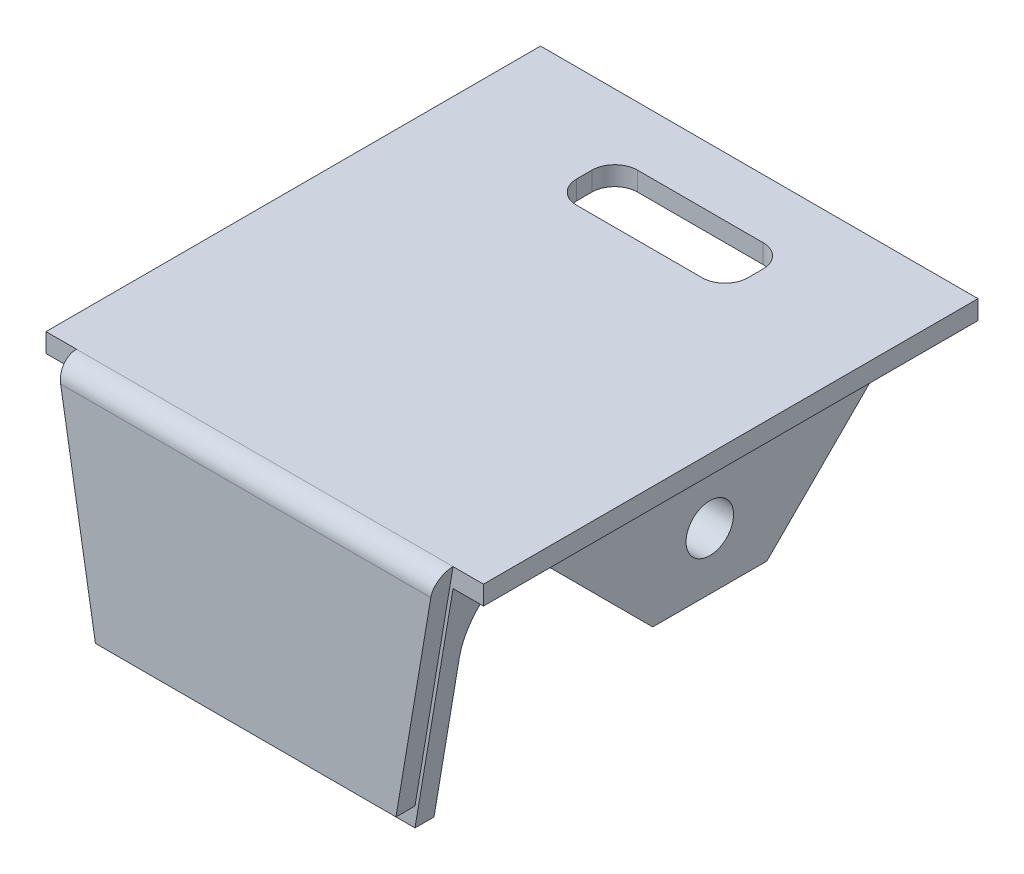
ISO-10303-21;
HEADER;
FILE_DESCRIPTION(('STEP AP214'),'2;1');
FILE_NAME('part.step','',(''),(''),'','','');
FILE_SCHEMA(('AUTOMOTIVE_DESIGN { 1 0 10303 214 1 1 1 1 }'));
ENDSEC;
DATA;
#1=APPLICATION_CONTEXT('core data for automotive mechanical design processes');
#2=APPLICATION_PROTOCOL_DEFINITION('international standard','automotive_design',2000,#1);
#3=PRODUCT_CONTEXT('',#1,'mechanical');
#4=PRODUCT('Part','Part','',(#3));
#5=PRODUCT_RELATED_PRODUCT_CATEGORY('part','',(#4));
#6=PRODUCT_DEFINITION_FORMATION('','',#4);
#7=PRODUCT_DEFINITION_CONTEXT('part definition',#1,'design');
#8=PRODUCT_DEFINITION('design','',#6,#7);
#9=PRODUCT_DEFINITION_SHAPE('','',#8);
#10=(LENGTH_UNIT() NAMED_UNIT(*) SI_UNIT(.MILLI.,.METRE.));
#11=(NAMED_UNIT(*) PLANE_ANGLE_UNIT() SI_UNIT($,.RADIAN.));
#12=(NAMED_UNIT(*) SI_UNIT($,.STERADIAN.) SOLID_ANGLE_UNIT());
#13=UNCERTAINTY_MEASURE_WITH_UNIT(LENGTH_MEASURE(1.E-05),#10,'distance_accuracy_value','');
#14=(GEOMETRIC_REPRESENTATION_CONTEXT(3) GLOBAL_UNCERTAINTY_ASSIGNED_CONTEXT((#13)) GLOBAL_UNIT_ASSIGNED_CONTEXT((#10,
#11,#12)) REPRESENTATION_CONTEXT('',''));
#15=CARTESIAN_POINT('',(0.,0.,0.));
#16=DIRECTION('',(0.,0.,1.));
#17=DIRECTION('',(1.,0.,0.));
#18=AXIS2_PLACEMENT_3D('',#15,#16,#17);
#19=CARTESIAN_POINT('',(0.,0.,0.));
#20=DIRECTION('',(0.,1.,0.));
#21=DIRECTION('',(0.,0.,1.));
#22=AXIS2_PLACEMENT_3D('',#19,#20,#21);
#23=PLANE('',#22);
#24=DIRECTION('',(-1.,0.,0.));
#25=VECTOR('',#24,1.);
#26=CARTESIAN_POINT('',(3.3,0.,-6.70000000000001));
#27=LINE('',#26,#25);
#28=CARTESIAN_POINT('',(3.3,0.,-6.70000000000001));
#29=VERTEX_POINT('',#28);
#30=CARTESIAN_POINT('',(-3.3,0.,-6.70000000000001));
#31=VERTEX_POINT('',#30);
#32=EDGE_CURVE('E631',#29,#31,#27,.T.);
#33=ORIENTED_EDGE('',*,*,#32,.F.);
#34=CARTESIAN_POINT('',(3.3,0.,-7.90000000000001));
#35=DIRECTION('',(0.,1.,0.));
#36=DIRECTION('',(0.,0.,1.));
#37=AXIS2_PLACEMENT_3D('',#34,#35,#36);
#38=CIRCLE('',#37,1.2);
#39=CARTESIAN_POINT('',(4.5,0.,-7.90000000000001));
#40=VERTEX_POINT('',#39);
#41=EDGE_CURVE('E302',#40,#29,#38,.F.);
#42=ORIENTED_EDGE('',*,*,#41,.F.);
#43=DIRECTION('',(0.,0.,1.));
#44=VECTOR('',#43,1.);
#45=CARTESIAN_POINT('',(4.5,0.,-8.70000000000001));
#46=LINE('',#45,#44);
#47=CARTESIAN_POINT('',(4.5,0.,-8.70000000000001));
#48=VERTEX_POINT('',#47);
#49=EDGE_CURVE('E299',#48,#40,#46,.T.);
#50=ORIENTED_EDGE('',*,*,#49,.F.);
#51=CARTESIAN_POINT('',(3.3,0.,-8.70000000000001));
#52=DIRECTION('',(0.,1.,0.));
#53=DIRECTION('',(0.,0.,1.));
#54=AXIS2_PLACEMENT_3D('',#51,#52,#53);
#55=CIRCLE('',#54,1.2);
#56=CARTESIAN_POINT('',(3.3,0.,-9.90000000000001));
#57=VERTEX_POINT('',#56);
#58=EDGE_CURVE('E251',#57,#48,#55,.F.);
#59=ORIENTED_EDGE('',*,*,#58,.F.);
#60=DIRECTION('',(1.,0.,0.));
#61=VECTOR('',#60,1.);
#62=CARTESIAN_POINT('',(3.3,0.,-9.90000000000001));
#63=LINE('',#62,#61);
#64=CARTESIAN_POINT('',(-3.3,0.,-9.90000000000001));
#65=VERTEX_POINT('',#64);
#66=EDGE_CURVE('E652',#65,#57,#63,.T.);
#67=ORIENTED_EDGE('',*,*,#66,.F.);
#68=CARTESIAN_POINT('',(-3.3,0.,-8.70000000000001));
#69=DIRECTION('',(0.,1.,0.));
#70=DIRECTION('',(0.,0.,1.));
#71=AXIS2_PLACEMENT_3D('',#68,#69,#70);
#72=CIRCLE('',#71,1.2);
#73=CARTESIAN_POINT('',(-4.5,0.,-8.70000000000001));
#74=VERTEX_POINT('',#73);
#75=EDGE_CURVE('E644',#74,#65,#72,.F.);
#76=ORIENTED_EDGE('',*,*,#75,.F.);
#77=DIRECTION('',(0.,0.,-1.));
#78=VECTOR('',#77,1.);
#79=CARTESIAN_POINT('',(-4.5,0.,-8.70000000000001));
#80=LINE('',#79,#78);
#81=CARTESIAN_POINT('',(-4.5,0.,-7.90000000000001));
#82=VERTEX_POINT('',#81);
#83=EDGE_CURVE('E642',#82,#74,#80,.T.);
#84=ORIENTED_EDGE('',*,*,#83,.F.);
#85=CARTESIAN_POINT('',(-3.3,0.,-7.90000000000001));
#86=DIRECTION('',(0.,1.,0.));
#87=DIRECTION('',(0.,0.,1.));
#88=AXIS2_PLACEMENT_3D('',#85,#86,#87);
#89=CIRCLE('',#88,1.2);
#90=EDGE_CURVE('E635',#31,#82,#89,.F.);
#91=ORIENTED_EDGE('',*,*,#90,.F.);
#92=EDGE_LOOP('',(#33,#42,#50,#59,#67,#76,#84,#91));
#93=FACE_BOUND('',#92,.T.);
#94=DIRECTION('',(0.,0.,1.));
#95=VECTOR('',#94,1.);
#96=CARTESIAN_POINT('',(9.90000000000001,0.,12.));
#97=LINE('',#96,#95);
#98=CARTESIAN_POINT('',(9.90000000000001,0.,9.49999999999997));
#99=VERTEX_POINT('',#98);
#100=CARTESIAN_POINT('',(9.90000000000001,0.,13.));
#101=VERTEX_POINT('',#100);
#102=EDGE_CURVE('E311',#99,#101,#97,.T.);
#103=ORIENTED_EDGE('',*,*,#102,.F.);
#104=DIRECTION('',(1.,0.,0.));
#105=VECTOR('',#104,1.);
#106=CARTESIAN_POINT('',(10.4,0.,9.49999999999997));
#107=LINE('',#106,#105);
#108=CARTESIAN_POINT('',(10.4,0.,9.49999999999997));
#109=VERTEX_POINT('',#108);
#110=EDGE_CURVE('E425',#99,#109,#107,.T.);
#111=ORIENTED_EDGE('',*,*,#110,.T.);
#112=DIRECTION('',(0.,0.,1.));
#113=VECTOR('',#112,1.);
#114=CARTESIAN_POINT('',(10.4,0.,-3.));
#115=LINE('',#114,#113);
#116=CARTESIAN_POINT('',(10.4,0.,-9.49999999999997));
#117=VERTEX_POINT('',#116);
#118=EDGE_CURVE('E385',#117,#109,#115,.T.);
#119=ORIENTED_EDGE('',*,*,#118,.F.);
#120=DIRECTION('',(-1.,0.,0.));
#121=VECTOR('',#120,1.);
#122=CARTESIAN_POINT('',(6.4,0.,-9.49999999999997));
#123=LINE('',#122,#121);
#124=CARTESIAN_POINT('',(6.4,0.,-9.49999999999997));
#125=VERTEX_POINT('',#124);
#126=EDGE_CURVE('E422',#117,#125,#123,.T.);
#127=ORIENTED_EDGE('',*,*,#126,.T.);
#128=DIRECTION('',(0.,0.,-1.));
#129=VECTOR('',#128,1.);
#130=CARTESIAN_POINT('',(6.4,0.,-3.));
#131=LINE('',#130,#129);
#132=CARTESIAN_POINT('',(6.4,0.,8.));
#133=VERTEX_POINT('',#132);
#134=EDGE_CURVE('E375',#133,#125,#131,.T.);
#135=ORIENTED_EDGE('',*,*,#134,.F.);
#136=DIRECTION('',(1.,0.,0.));
#137=VECTOR('',#136,1.);
#138=CARTESIAN_POINT('',(-9.90000000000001,0.,8.));
#139=LINE('',#138,#137);
#140=CARTESIAN_POINT('',(-6.4,0.,8.));
#141=VERTEX_POINT('',#140);
#142=EDGE_CURVE('E458',#133,#141,#139,.F.);
#143=ORIENTED_EDGE('',*,*,#142,.T.);
#144=DIRECTION('',(0.,0.,-1.));
#145=VECTOR('',#144,1.);
#146=CARTESIAN_POINT('',(-6.4,0.,-3.));
#147=LINE('',#146,#145);
#148=CARTESIAN_POINT('',(-6.4,0.,-9.49999999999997));
#149=VERTEX_POINT('',#148);
#150=EDGE_CURVE('E355',#141,#149,#147,.T.);
#151=ORIENTED_EDGE('',*,*,#150,.T.);
#152=DIRECTION('',(-1.,0.,0.));
#153=VECTOR('',#152,1.);
#154=CARTESIAN_POINT('',(0.,0.,-9.49999999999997));
#155=LINE('',#154,#153);
#156=CARTESIAN_POINT('',(-10.4,0.,-9.49999999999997));
#157=VERTEX_POINT('',#156);
#158=EDGE_CURVE('E437',#149,#157,#155,.T.);
#159=ORIENTED_EDGE('',*,*,#158,.T.);
#160=DIRECTION('',(0.,0.,1.));
#161=VECTOR('',#160,1.);
#162=CARTESIAN_POINT('',(-10.4,0.,-3.));
#163=LINE('',#162,#161);
#164=CARTESIAN_POINT('',(-10.4,0.,9.49999999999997));
#165=VERTEX_POINT('',#164);
#166=EDGE_CURVE('E365',#157,#165,#163,.T.);
#167=ORIENTED_EDGE('',*,*,#166,.T.);
#168=DIRECTION('',(1.,0.,0.));
#169=VECTOR('',#168,1.);
#170=CARTESIAN_POINT('',(0.,0.,9.49999999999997));
#171=LINE('',#170,#169);
#172=CARTESIAN_POINT('',(-9.90000000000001,0.,9.49999999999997));
#173=VERTEX_POINT('',#172);
#174=EDGE_CURVE('E442',#165,#173,#171,.T.);
#175=ORIENTED_EDGE('',*,*,#174,.T.);
#176=DIRECTION('',(0.,0.,1.));
#177=VECTOR('',#176,1.);
#178=CARTESIAN_POINT('',(-9.90000000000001,0.,12.));
#179=LINE('',#178,#177);
#180=CARTESIAN_POINT('',(-9.90000000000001,0.,13.));
#181=VERTEX_POINT('',#180);
#182=EDGE_CURVE('E318',#173,#181,#179,.T.);
#183=ORIENTED_EDGE('',*,*,#182,.T.);
#184=DIRECTION('',(1.,0.,0.));
#185=VECTOR('',#184,1.);
#186=CARTESIAN_POINT('',(-11.5,0.,13.));
#187=LINE('',#186,#185);
#188=CARTESIAN_POINT('',(-11.5,0.,13.));
#189=VERTEX_POINT('',#188);
#190=EDGE_CURVE('E405',#189,#181,#187,.T.);
#191=ORIENTED_EDGE('',*,*,#190,.F.);
#192=DIRECTION('',(0.,0.,1.));
#193=VECTOR('',#192,1.);
#194=CARTESIAN_POINT('',(-11.5,0.,13.));
#195=LINE('',#194,#193);
#196=CARTESIAN_POINT('',(-11.5,0.,-13.));
#197=VERTEX_POINT('',#196);
#198=EDGE_CURVE('E384',#197,#189,#195,.T.);
#199=ORIENTED_EDGE('',*,*,#198,.F.);
#200=DIRECTION('',(-1.,0.,0.));
#201=VECTOR('',#200,1.);
#202=CARTESIAN_POINT('',(11.5,0.,-13.));
#203=LINE('',#202,#201);
#204=CARTESIAN_POINT('',(11.5,0.,-13.));
#205=VERTEX_POINT('',#204);
#206=EDGE_CURVE('E393',#205,#197,#203,.T.);
#207=ORIENTED_EDGE('',*,*,#206,.F.);
#208=DIRECTION('',(0.,0.,-1.));
#209=VECTOR('',#208,1.);
#210=CARTESIAN_POINT('',(11.5,0.,13.));
#211=LINE('',#210,#209);
#212=CARTESIAN_POINT('',(11.5,0.,13.));
#213=VERTEX_POINT('',#212);
#214=EDGE_CURVE('E408',#213,#205,#211,.T.);
#215=ORIENTED_EDGE('',*,*,#214,.F.);
#216=EDGE_CURVE('E404',#101,#213,#187,.T.);
#217=ORIENTED_EDGE('',*,*,#216,.F.);
#218=EDGE_LOOP('',(#103,#111,#119,#127,#135,#143,#151,#159,#167,#175,#183,#191,#199,#207,#215,#217));
#219=FACE_BOUND('',#218,.T.);
#220=ADVANCED_FACE('F39',(#93,#219),#23,.F.);
#221=CARTESIAN_POINT('',(-11.5,1.,13.));
#222=DIRECTION('',(0.,0.,-1.));
#223=DIRECTION('',(-1.,0.,0.));
#224=AXIS2_PLACEMENT_3D('',#221,#222,#223);
#225=PLANE('',#224);
#226=DIRECTION('',(0.165742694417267,0.986169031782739,0.));
#227=VECTOR('',#226,1.);
#228=CARTESIAN_POINT('',(9.90000000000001,1.,13.));
#229=LINE('',#228,#227);
#230=CARTESIAN_POINT('',(7.90000000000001,-10.9,13.));
#231=VERTEX_POINT('',#230);
#232=CARTESIAN_POINT('',(9.90000000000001,1.,13.));
#233=VERTEX_POINT('',#232);
#234=EDGE_CURVE('E339',#231,#233,#229,.T.);
#235=ORIENTED_EDGE('',*,*,#234,.F.);
#236=DIRECTION('',(1.,0.,0.));
#237=VECTOR('',#236,1.);
#238=CARTESIAN_POINT('',(-7.9,-10.9,13.));
#239=LINE('',#238,#237);
#240=CARTESIAN_POINT('',(-7.9,-10.9,13.));
#241=VERTEX_POINT('',#240);
#242=EDGE_CURVE('E331',#241,#231,#239,.T.);
#243=ORIENTED_EDGE('',*,*,#242,.F.);
#244=DIRECTION('',(0.165742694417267,-0.986169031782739,0.));
#245=VECTOR('',#244,1.);
#246=CARTESIAN_POINT('',(-9.9,1.,13.));
#247=LINE('',#246,#245);
#248=CARTESIAN_POINT('',(-9.9,1.,13.));
#249=VERTEX_POINT('',#248);
#250=EDGE_CURVE('E327',#249,#241,#247,.T.);
#251=ORIENTED_EDGE('',*,*,#250,.F.);
#252=DIRECTION('',(1.,0.,0.));
#253=VECTOR('',#252,1.);
#254=CARTESIAN_POINT('',(-11.5,1.,13.));
#255=LINE('',#254,#253);
#256=CARTESIAN_POINT('',(-11.5,1.,13.));
#257=VERTEX_POINT('',#256);
#258=EDGE_CURVE('E394',#257,#249,#255,.T.);
#259=ORIENTED_EDGE('',*,*,#258,.F.);
#260=DIRECTION('',(0.,-1.,0.));
#261=VECTOR('',#260,1.);
#262=CARTESIAN_POINT('',(-11.5,1.,13.));
#263=LINE('',#262,#261);
#264=EDGE_CURVE('E419',#257,#189,#263,.T.);
#265=ORIENTED_EDGE('',*,*,#264,.T.);
#266=ORIENTED_EDGE('',*,*,#190,.T.);
#267=DIRECTION('',(-0.165742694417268,0.986169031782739,0.));
#268=VECTOR('',#267,1.);
#269=CARTESIAN_POINT('',(-7.90000000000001,-11.9,13.));
#270=LINE('',#269,#268);
#271=CARTESIAN_POINT('',(-7.90000000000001,-11.9,13.));
#272=VERTEX_POINT('',#271);
#273=EDGE_CURVE('E306',#272,#181,#270,.T.);
#274=ORIENTED_EDGE('',*,*,#273,.F.);
#275=DIRECTION('',(-1.,0.,0.));
#276=VECTOR('',#275,1.);
#277=CARTESIAN_POINT('',(7.90000000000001,-11.9,13.));
#278=LINE('',#277,#276);
#279=CARTESIAN_POINT('',(7.90000000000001,-11.9,13.));
#280=VERTEX_POINT('',#279);
#281=EDGE_CURVE('E314',#280,#272,#278,.T.);
#282=ORIENTED_EDGE('',*,*,#281,.F.);
#283=DIRECTION('',(-0.165742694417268,-0.986169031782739,0.));
#284=VECTOR('',#283,1.);
#285=CARTESIAN_POINT('',(7.90000000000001,-11.9,13.));
#286=LINE('',#285,#284);
#287=EDGE_CURVE('E301',#101,#280,#286,.T.);
#288=ORIENTED_EDGE('',*,*,#287,.F.);
#289=ORIENTED_EDGE('',*,*,#216,.T.);
#290=DIRECTION('',(0.,-1.,0.));
#291=VECTOR('',#290,1.);
#292=CARTESIAN_POINT('',(11.5,1.,13.));
#293=LINE('',#292,#291);
#294=CARTESIAN_POINT('',(11.5,1.,13.));
#295=VERTEX_POINT('',#294);
#296=EDGE_CURVE('E416',#295,#213,#293,.T.);
#297=ORIENTED_EDGE('',*,*,#296,.F.);
#298=EDGE_CURVE('E392',#233,#295,#255,.T.);
#299=ORIENTED_EDGE('',*,*,#298,.F.);
#300=EDGE_LOOP('',(#235,#243,#251,#259,#265,#266,#274,#282,#288,#289,#297,#299));
#301=FACE_BOUND('',#300,.T.);
#302=ADVANCED_FACE('F484',(#301),#225,.F.);
#303=CARTESIAN_POINT('',(-11.5,1.,13.));
#304=DIRECTION('',(1.,0.,0.));
#305=DIRECTION('',(0.,0.,-1.));
#306=AXIS2_PLACEMENT_3D('',#303,#304,#305);
#307=PLANE('',#306);
#308=ORIENTED_EDGE('',*,*,#198,.T.);
#309=ORIENTED_EDGE('',*,*,#264,.F.);
#310=DIRECTION('',(0.,0.,1.));
#311=VECTOR('',#310,1.);
#312=CARTESIAN_POINT('',(-11.5,1.,13.));
#313=LINE('',#312,#311);
#314=CARTESIAN_POINT('',(-11.5,1.,-13.));
#315=VERTEX_POINT('',#314);
#316=EDGE_CURVE('E389',#315,#257,#313,.T.);
#317=ORIENTED_EDGE('',*,*,#316,.F.);
#318=DIRECTION('',(0.,-1.,0.));
#319=VECTOR('',#318,1.);
#320=CARTESIAN_POINT('',(-11.5,1.,-13.));
#321=LINE('',#320,#319);
#322=EDGE_CURVE('E401',#315,#197,#321,.T.);
#323=ORIENTED_EDGE('',*,*,#322,.T.);
#324=EDGE_LOOP('',(#308,#309,#317,#323));
#325=FACE_BOUND('',#324,.T.);
#326=ADVANCED_FACE('F504',(#325),#307,.F.);
#327=CARTESIAN_POINT('',(11.5,1.,13.));
#328=DIRECTION('',(-1.,0.,0.));
#329=DIRECTION('',(0.,0.,1.));
#330=AXIS2_PLACEMENT_3D('',#327,#328,#329);
#331=PLANE('',#330);
#332=ORIENTED_EDGE('',*,*,#214,.T.);
#333=DIRECTION('',(0.,-1.,0.));
#334=VECTOR('',#333,1.);
#335=CARTESIAN_POINT('',(11.5,1.,-13.));
#336=LINE('',#335,#334);
#337=CARTESIAN_POINT('',(11.5,1.,-13.));
#338=VERTEX_POINT('',#337);
#339=EDGE_CURVE('E413',#338,#205,#336,.T.);
#340=ORIENTED_EDGE('',*,*,#339,.F.);
#341=DIRECTION('',(0.,0.,-1.));
#342=VECTOR('',#341,1.);
#343=CARTESIAN_POINT('',(11.5,1.,13.));
#344=LINE('',#343,#342);
#345=EDGE_CURVE('E397',#295,#338,#344,.T.);
#346=ORIENTED_EDGE('',*,*,#345,.F.);
#347=ORIENTED_EDGE('',*,*,#296,.T.);
#348=EDGE_LOOP('',(#332,#340,#346,#347));
#349=FACE_BOUND('',#348,.T.);
#350=ADVANCED_FACE('F526',(#349),#331,.F.);
#351=CARTESIAN_POINT('',(11.5,1.,-13.));
#352=DIRECTION('',(0.,0.,1.));
#353=DIRECTION('',(1.,0.,0.));
#354=AXIS2_PLACEMENT_3D('',#351,#352,#353);
#355=PLANE('',#354);
#356=ORIENTED_EDGE('',*,*,#206,.T.);
#357=ORIENTED_EDGE('',*,*,#322,.F.);
#358=DIRECTION('',(-1.,0.,0.));
#359=VECTOR('',#358,1.);
#360=CARTESIAN_POINT('',(11.5,1.,-13.));
#361=LINE('',#360,#359);
#362=EDGE_CURVE('E399',#338,#315,#361,.T.);
#363=ORIENTED_EDGE('',*,*,#362,.F.);
#364=ORIENTED_EDGE('',*,*,#339,.T.);
#365=EDGE_LOOP('',(#356,#357,#363,#364));
#366=FACE_BOUND('',#365,.T.);
#367=ADVANCED_FACE('F528',(#366),#355,.F.);
#368=CARTESIAN_POINT('',(0.,1.,0.));
#369=DIRECTION('',(0.,1.,0.));
#370=DIRECTION('',(0.,0.,1.));
#371=AXIS2_PLACEMENT_3D('',#368,#369,#370);
#372=PLANE('',#371);
#373=CARTESIAN_POINT('',(3.3,1.,-7.90000000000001));
#374=DIRECTION('',(0.,1.,0.));
#375=DIRECTION('',(0.,0.,-1.));
#376=AXIS2_PLACEMENT_3D('',#373,#374,#375);
#377=CIRCLE('',#376,1.2);
#378=CARTESIAN_POINT('',(3.3,1.,-6.70000000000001));
#379=VERTEX_POINT('',#378);
#380=CARTESIAN_POINT('',(4.5,1.,-7.90000000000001));
#381=VERTEX_POINT('',#380);
#382=EDGE_CURVE('E264',#379,#381,#377,.T.);
#383=ORIENTED_EDGE('',*,*,#382,.F.);
#384=DIRECTION('',(1.,0.,0.));
#385=VECTOR('',#384,1.);
#386=CARTESIAN_POINT('',(3.3,1.,-6.70000000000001));
#387=LINE('',#386,#385);
#388=CARTESIAN_POINT('',(-3.3,1.,-6.70000000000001));
#389=VERTEX_POINT('',#388);
#390=EDGE_CURVE('E284',#389,#379,#387,.T.);
#391=ORIENTED_EDGE('',*,*,#390,.F.);
#392=CARTESIAN_POINT('',(-3.3,1.,-7.90000000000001));
#393=DIRECTION('',(0.,1.,0.));
#394=DIRECTION('',(0.,0.,-1.));
#395=AXIS2_PLACEMENT_3D('',#392,#393,#394);
#396=CIRCLE('',#395,1.2);
#397=CARTESIAN_POINT('',(-4.5,1.,-7.90000000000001));
#398=VERTEX_POINT('',#397);
#399=EDGE_CURVE('E281',#398,#389,#396,.T.);
#400=ORIENTED_EDGE('',*,*,#399,.F.);
#401=DIRECTION('',(0.,0.,1.));
#402=VECTOR('',#401,1.);
#403=CARTESIAN_POINT('',(-4.5,1.,-8.70000000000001));
#404=LINE('',#403,#402);
#405=CARTESIAN_POINT('',(-4.5,1.,-8.70000000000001));
#406=VERTEX_POINT('',#405);
#407=EDGE_CURVE('E278',#406,#398,#404,.T.);
#408=ORIENTED_EDGE('',*,*,#407,.F.);
#409=CARTESIAN_POINT('',(-3.3,1.,-8.70000000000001));
#410=DIRECTION('',(0.,1.,0.));
#411=DIRECTION('',(0.,0.,1.));
#412=AXIS2_PLACEMENT_3D('',#409,#410,#411);
#413=CIRCLE('',#412,1.2);
#414=CARTESIAN_POINT('',(-3.3,1.,-9.90000000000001));
#415=VERTEX_POINT('',#414);
#416=EDGE_CURVE('E272',#415,#406,#413,.T.);
#417=ORIENTED_EDGE('',*,*,#416,.F.);
#418=DIRECTION('',(-1.,0.,0.));
#419=VECTOR('',#418,1.);
#420=CARTESIAN_POINT('',(3.3,1.,-9.90000000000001));
#421=LINE('',#420,#419);
#422=CARTESIAN_POINT('',(3.3,1.,-9.90000000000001));
#423=VERTEX_POINT('',#422);
#424=EDGE_CURVE('E270',#423,#415,#421,.T.);
#425=ORIENTED_EDGE('',*,*,#424,.F.);
#426=CARTESIAN_POINT('',(3.3,1.,-8.70000000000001));
#427=DIRECTION('',(0.,1.,0.));
#428=DIRECTION('',(0.,0.,-1.));
#429=AXIS2_PLACEMENT_3D('',#426,#427,#428);
#430=CIRCLE('',#429,1.2);
#431=CARTESIAN_POINT('',(4.5,1.,-8.70000000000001));
#432=VERTEX_POINT('',#431);
#433=EDGE_CURVE('E248',#432,#423,#430,.T.);
#434=ORIENTED_EDGE('',*,*,#433,.F.);
#435=DIRECTION('',(0.,0.,-1.));
#436=VECTOR('',#435,1.);
#437=CARTESIAN_POINT('',(4.5,1.,-8.70000000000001));
#438=LINE('',#437,#436);
#439=EDGE_CURVE('E259',#381,#432,#438,.T.);
#440=ORIENTED_EDGE('',*,*,#439,.F.);
#441=EDGE_LOOP('',(#383,#391,#400,#408,#417,#425,#434,#440));
#442=FACE_BOUND('',#441,.T.);
#443=ORIENTED_EDGE('',*,*,#258,.T.);
#444=DIRECTION('',(-1.,0.,0.));
#445=VECTOR('',#444,1.);
#446=CARTESIAN_POINT('',(0.,1.,13.));
#447=LINE('',#446,#445);
#448=EDGE_CURVE('E47',#249,#233,#447,.F.);
#449=ORIENTED_EDGE('',*,*,#448,.T.);
#450=ORIENTED_EDGE('',*,*,#298,.T.);
#451=ORIENTED_EDGE('',*,*,#345,.T.);
#452=ORIENTED_EDGE('',*,*,#362,.T.);
#453=ORIENTED_EDGE('',*,*,#316,.T.);
#454=EDGE_LOOP('',(#443,#449,#450,#451,#452,#453));
#455=FACE_BOUND('',#454,.T.);
#456=ADVANCED_FACE('F266',(#442,#455),#372,.T.);
#457=CARTESIAN_POINT('',(10.4,-6.5,-3.));
#458=DIRECTION('',(-1.,0.,0.));
#459=DIRECTION('',(0.,0.,1.));
#460=AXIS2_PLACEMENT_3D('',#457,#458,#459);
#461=PLANE('',#460);
#462=CARTESIAN_POINT('',(10.4,-3.5,0.));
#463=DIRECTION('',(1.,0.,0.));
#464=DIRECTION('',(0.,0.,-1.));
#465=AXIS2_PLACEMENT_3D('',#462,#463,#464);
#466=CIRCLE('',#465,1.25);
#467=CARTESIAN_POINT('',(10.4,-3.5,-1.25));
#468=VERTEX_POINT('',#467);
#469=EDGE_CURVE('E364',#468,#468,#466,.T.);
#470=ORIENTED_EDGE('',*,*,#469,.F.);
#471=EDGE_LOOP('',(#470));
#472=FACE_BOUND('',#471,.T.);
#473=ORIENTED_EDGE('',*,*,#118,.T.);
#474=DIRECTION('',(0.,0.707106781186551,0.707106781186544));
#475=VECTOR('',#474,1.);
#476=CARTESIAN_POINT('',(10.4,-9.50000000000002,0.));
#477=LINE('',#476,#475);
#478=CARTESIAN_POINT('',(10.4,-6.5,3.));
#479=VERTEX_POINT('',#478);
#480=EDGE_CURVE('E430',#109,#479,#477,.F.);
#481=ORIENTED_EDGE('',*,*,#480,.T.);
#482=DIRECTION('',(0.,0.,1.));
#483=VECTOR('',#482,1.);
#484=CARTESIAN_POINT('',(10.4,-6.5,-3.));
#485=LINE('',#484,#483);
#486=CARTESIAN_POINT('',(10.4,-6.5,-3.));
#487=VERTEX_POINT('',#486);
#488=EDGE_CURVE('E371',#487,#479,#485,.T.);
#489=ORIENTED_EDGE('',*,*,#488,.F.);
#490=DIRECTION('',(0.,-0.707106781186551,0.707106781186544));
#491=VECTOR('',#490,1.);
#492=CARTESIAN_POINT('',(10.4,-6.50000000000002,-3.00000000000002));
#493=LINE('',#492,#491);
#494=EDGE_CURVE('E432',#487,#117,#493,.F.);
#495=ORIENTED_EDGE('',*,*,#494,.T.);
#496=EDGE_LOOP('',(#473,#481,#489,#495));
#497=FACE_BOUND('',#496,.T.);
#498=ADVANCED_FACE('F535',(#472,#497),#461,.F.);
#499=CARTESIAN_POINT('',(6.4,-6.5,-3.));
#500=DIRECTION('',(1.,0.,0.));
#501=DIRECTION('',(0.,0.,-1.));
#502=AXIS2_PLACEMENT_3D('',#499,#500,#501);
#503=PLANE('',#502);
#504=CARTESIAN_POINT('',(6.4,-3.5,0.));
#505=DIRECTION('',(1.,0.,0.));
#506=DIRECTION('',(0.,0.,-1.));
#507=AXIS2_PLACEMENT_3D('',#504,#505,#506);
#508=CIRCLE('',#507,1.25);
#509=CARTESIAN_POINT('',(6.4,-3.5,-1.25));
#510=VERTEX_POINT('',#509);
#511=EDGE_CURVE('E370',#510,#510,#508,.T.);
#512=ORIENTED_EDGE('',*,*,#511,.T.);
#513=EDGE_LOOP('',(#512));
#514=FACE_BOUND('',#513,.T.);
#515=DIRECTION('',(0.,-0.707106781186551,-0.707106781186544));
#516=VECTOR('',#515,1.);
#517=CARTESIAN_POINT('',(6.4,-9.50000000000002,0.));
#518=LINE('',#517,#516);
#519=CARTESIAN_POINT('',(6.4,-6.5,3.));
#520=VERTEX_POINT('',#519);
#521=CARTESIAN_POINT('',(6.4,-0.212777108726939,9.28722289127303));
#522=VERTEX_POINT('',#521);
#523=EDGE_CURVE('E427',#520,#522,#518,.F.);
#524=ORIENTED_EDGE('',*,*,#523,.T.);
#525=CARTESIAN_POINT('',(6.4,-4.,8.));
#526=DIRECTION('',(1.,0.,0.));
#527=DIRECTION('',(0.,0.,-1.));
#528=AXIS2_PLACEMENT_3D('',#525,#526,#527);
#529=CIRCLE('',#528,4.);
#530=EDGE_CURVE('E465',#522,#133,#529,.F.);
#531=ORIENTED_EDGE('',*,*,#530,.T.);
#532=ORIENTED_EDGE('',*,*,#134,.T.);
#533=DIRECTION('',(0.,0.707106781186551,-0.707106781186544));
#534=VECTOR('',#533,1.);
#535=CARTESIAN_POINT('',(6.4,-6.50000000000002,-3.00000000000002));
#536=LINE('',#535,#534);
#537=CARTESIAN_POINT('',(6.4,-6.5,-3.));
#538=VERTEX_POINT('',#537);
#539=EDGE_CURVE('E435',#125,#538,#536,.F.);
#540=ORIENTED_EDGE('',*,*,#539,.T.);
#541=DIRECTION('',(0.,0.,-1.));
#542=VECTOR('',#541,1.);
#543=CARTESIAN_POINT('',(6.4,-6.5,-3.));
#544=LINE('',#543,#542);
#545=EDGE_CURVE('E378',#520,#538,#544,.T.);
#546=ORIENTED_EDGE('',*,*,#545,.F.);
#547=EDGE_LOOP('',(#524,#531,#532,#540,#546));
#548=FACE_BOUND('',#547,.T.);
#549=ADVANCED_FACE('F549',(#514,#548),#503,.F.);
#550=CARTESIAN_POINT('',(0.,-6.5,0.));
#551=DIRECTION('',(0.,1.,0.));
#552=DIRECTION('',(0.,0.,1.));
#553=AXIS2_PLACEMENT_3D('',#550,#551,#552);
#554=PLANE('',#553);
#555=ORIENTED_EDGE('',*,*,#488,.T.);
#556=DIRECTION('',(-1.,0.,0.));
#557=VECTOR('',#556,1.);
#558=CARTESIAN_POINT('',(6.4,-6.5,3.));
#559=LINE('',#558,#557);
#560=EDGE_CURVE('E374',#479,#520,#559,.T.);
#561=ORIENTED_EDGE('',*,*,#560,.T.);
#562=ORIENTED_EDGE('',*,*,#545,.T.);
#563=DIRECTION('',(1.,0.,0.));
#564=VECTOR('',#563,1.);
#565=CARTESIAN_POINT('',(6.4,-6.5,-3.));
#566=LINE('',#565,#564);
#567=EDGE_CURVE('E381',#538,#487,#566,.T.);
#568=ORIENTED_EDGE('',*,*,#567,.T.);
#569=EDGE_LOOP('',(#555,#561,#562,#568));
#570=FACE_BOUND('',#569,.T.);
#571=ADVANCED_FACE('F553',(#570),#554,.F.);
#572=CARTESIAN_POINT('',(6.4,-6.50000000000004,3.));
#573=DIRECTION('',(0.,-0.707106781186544,0.707106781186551));
#574=DIRECTION('',(1.,0.,0.));
#575=AXIS2_PLACEMENT_3D('',#572,#573,#574);
#576=PLANE('',#575);
#577=ORIENTED_EDGE('',*,*,#110,.F.);
#578=DIRECTION('',(0.118011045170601,0.702165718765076,0.702165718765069));
#579=VECTOR('',#578,1.);
#580=CARTESIAN_POINT('',(9.09323166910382,-4.8002715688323,4.69972843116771));
#581=LINE('',#580,#579);
#582=CARTESIAN_POINT('',(9.86423914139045,-0.212777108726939,9.28722289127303));
#583=VERTEX_POINT('',#582);
#584=EDGE_CURVE('E462',#99,#583,#581,.F.);
#585=ORIENTED_EDGE('',*,*,#584,.T.);
#586=DIRECTION('',(-1.,0.,0.));
#587=VECTOR('',#586,1.);
#588=CARTESIAN_POINT('',(0.,-0.212777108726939,9.28722289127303));
#589=LINE('',#588,#587);
#590=EDGE_CURVE('E460',#583,#522,#589,.T.);
#591=ORIENTED_EDGE('',*,*,#590,.T.);
#592=ORIENTED_EDGE('',*,*,#523,.F.);
#593=ORIENTED_EDGE('',*,*,#560,.F.);
#594=ORIENTED_EDGE('',*,*,#480,.F.);
#595=EDGE_LOOP('',(#577,#585,#591,#592,#593,#594));
#596=FACE_BOUND('',#595,.T.);
#597=ADVANCED_FACE('F557',(#596),#576,.T.);
#598=CARTESIAN_POINT('',(6.4,-6.50000000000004,-3.));
#599=DIRECTION('',(0.,-0.707106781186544,-0.707106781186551));
#600=DIRECTION('',(-1.,0.,0.));
#601=AXIS2_PLACEMENT_3D('',#598,#599,#600);
#602=PLANE('',#601);
#603=ORIENTED_EDGE('',*,*,#539,.F.);
#604=ORIENTED_EDGE('',*,*,#126,.F.);
#605=ORIENTED_EDGE('',*,*,#494,.F.);
#606=ORIENTED_EDGE('',*,*,#567,.F.);
#607=EDGE_LOOP('',(#603,#604,#605,#606));
#608=FACE_BOUND('',#607,.T.);
#609=ADVANCED_FACE('F563',(#608),#602,.T.);
#610=CARTESIAN_POINT('',(-11.5,-3.5,0.));
#611=DIRECTION('',(1.,0.,0.));
#612=DIRECTION('',(0.,0.,-1.));
#613=AXIS2_PLACEMENT_3D('',#610,#611,#612);
#614=CYLINDRICAL_SURFACE('',#613,1.25);
#615=ORIENTED_EDGE('',*,*,#469,.T.);
#616=EDGE_LOOP('',(#615));
#617=FACE_BOUND('',#616,.T.);
#618=ORIENTED_EDGE('',*,*,#511,.F.);
#619=EDGE_LOOP('',(#618));
#620=FACE_BOUND('',#619,.T.);
#621=ADVANCED_FACE('F559',(#617,#620),#614,.F.);
#622=CARTESIAN_POINT('',(-10.4,-6.5,-3.));
#623=DIRECTION('',(-1.,0.,0.));
#624=DIRECTION('',(0.,0.,1.));
#625=AXIS2_PLACEMENT_3D('',#622,#623,#624);
#626=PLANE('',#625);
#627=CARTESIAN_POINT('',(-10.4,-3.5,0.));
#628=DIRECTION('',(1.,0.,0.));
#629=DIRECTION('',(0.,0.,-1.));
#630=AXIS2_PLACEMENT_3D('',#627,#628,#629);
#631=CIRCLE('',#630,1.25);
#632=CARTESIAN_POINT('',(-10.4,-3.5,-1.25));
#633=VERTEX_POINT('',#632);
#634=EDGE_CURVE('E348',#633,#633,#631,.T.);
#635=ORIENTED_EDGE('',*,*,#634,.T.);
#636=EDGE_LOOP('',(#635));
#637=FACE_BOUND('',#636,.T.);
#638=ORIENTED_EDGE('',*,*,#166,.F.);
#639=DIRECTION('',(0.,-0.707106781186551,0.707106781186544));
#640=VECTOR('',#639,1.);
#641=CARTESIAN_POINT('',(-10.4,0.,-9.49999999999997));
#642=LINE('',#641,#640);
#643=CARTESIAN_POINT('',(-10.4,-6.5,-3.));
#644=VERTEX_POINT('',#643);
#645=EDGE_CURVE('E450',#157,#644,#642,.T.);
#646=ORIENTED_EDGE('',*,*,#645,.T.);
#647=DIRECTION('',(0.,0.,1.));
#648=VECTOR('',#647,1.);
#649=CARTESIAN_POINT('',(-10.4,-6.5,-3.));
#650=LINE('',#649,#648);
#651=CARTESIAN_POINT('',(-10.4,-6.5,3.));
#652=VERTEX_POINT('',#651);
#653=EDGE_CURVE('E352',#644,#652,#650,.T.);
#654=ORIENTED_EDGE('',*,*,#653,.T.);
#655=DIRECTION('',(0.,0.707106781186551,0.707106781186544));
#656=VECTOR('',#655,1.);
#657=CARTESIAN_POINT('',(-10.4,0.,9.49999999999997));
#658=LINE('',#657,#656);
#659=EDGE_CURVE('E447',#652,#165,#658,.T.);
#660=ORIENTED_EDGE('',*,*,#659,.T.);
#661=EDGE_LOOP('',(#638,#646,#654,#660));
#662=FACE_BOUND('',#661,.T.);
#663=ADVANCED_FACE('F562',(#637,#662),#626,.T.);
#664=CARTESIAN_POINT('',(-6.4,-6.5,-3.));
#665=DIRECTION('',(1.,0.,0.));
#666=DIRECTION('',(0.,0.,-1.));
#667=AXIS2_PLACEMENT_3D('',#664,#665,#666);
#668=PLANE('',#667);
#669=CARTESIAN_POINT('',(-6.4,-3.5,0.));
#670=DIRECTION('',(1.,0.,0.));
#671=DIRECTION('',(0.,0.,-1.));
#672=AXIS2_PLACEMENT_3D('',#669,#670,#671);
#673=CIRCLE('',#672,1.25);
#674=CARTESIAN_POINT('',(-6.4,-3.5,-1.25));
#675=VERTEX_POINT('',#674);
#676=EDGE_CURVE('E351',#675,#675,#673,.F.);
#677=ORIENTED_EDGE('',*,*,#676,.T.);
#678=EDGE_LOOP('',(#677));
#679=FACE_BOUND('',#678,.T.);
#680=ORIENTED_EDGE('',*,*,#150,.F.);
#681=CARTESIAN_POINT('',(-6.4,-4.,8.));
#682=DIRECTION('',(1.,0.,0.));
#683=DIRECTION('',(0.,0.,-1.));
#684=AXIS2_PLACEMENT_3D('',#681,#682,#683);
#685=CIRCLE('',#684,4.);
#686=CARTESIAN_POINT('',(-6.4,-0.212777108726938,9.28722289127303));
#687=VERTEX_POINT('',#686);
#688=EDGE_CURVE('E467',#141,#687,#685,.T.);
#689=ORIENTED_EDGE('',*,*,#688,.T.);
#690=DIRECTION('',(0.,-0.707106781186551,-0.707106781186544));
#691=VECTOR('',#690,1.);
#692=CARTESIAN_POINT('',(-6.4,0.,9.49999999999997));
#693=LINE('',#692,#691);
#694=CARTESIAN_POINT('',(-6.4,-6.5,3.));
#695=VERTEX_POINT('',#694);
#696=EDGE_CURVE('E445',#687,#695,#693,.T.);
#697=ORIENTED_EDGE('',*,*,#696,.T.);
#698=DIRECTION('',(0.,0.,-1.));
#699=VECTOR('',#698,1.);
#700=CARTESIAN_POINT('',(-6.4,-6.5,-3.));
#701=LINE('',#700,#699);
#702=CARTESIAN_POINT('',(-6.4,-6.5,-3.));
#703=VERTEX_POINT('',#702);
#704=EDGE_CURVE('E358',#695,#703,#701,.T.);
#705=ORIENTED_EDGE('',*,*,#704,.T.);
#706=DIRECTION('',(0.,0.707106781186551,-0.707106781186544));
#707=VECTOR('',#706,1.);
#708=CARTESIAN_POINT('',(-6.4,0.,-9.49999999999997));
#709=LINE('',#708,#707);
#710=EDGE_CURVE('E342',#703,#149,#709,.T.);
#711=ORIENTED_EDGE('',*,*,#710,.T.);
#712=EDGE_LOOP('',(#680,#689,#697,#705,#711));
#713=FACE_BOUND('',#712,.T.);
#714=ADVANCED_FACE('F567',(#679,#713),#668,.T.);
#715=CARTESIAN_POINT('',(0.,-6.5,0.));
#716=DIRECTION('',(0.,1.,0.));
#717=DIRECTION('',(0.,0.,1.));
#718=AXIS2_PLACEMENT_3D('',#715,#716,#717);
#719=PLANE('',#718);
#720=ORIENTED_EDGE('',*,*,#653,.F.);
#721=DIRECTION('',(-1.,0.,0.));
#722=VECTOR('',#721,1.);
#723=CARTESIAN_POINT('',(-6.4,-6.5,-3.));
#724=LINE('',#723,#722);
#725=EDGE_CURVE('E354',#703,#644,#724,.T.);
#726=ORIENTED_EDGE('',*,*,#725,.F.);
#727=ORIENTED_EDGE('',*,*,#704,.F.);
#728=DIRECTION('',(1.,0.,0.));
#729=VECTOR('',#728,1.);
#730=CARTESIAN_POINT('',(-6.4,-6.5,3.));
#731=LINE('',#730,#729);
#732=EDGE_CURVE('E361',#652,#695,#731,.T.);
#733=ORIENTED_EDGE('',*,*,#732,.F.);
#734=EDGE_LOOP('',(#720,#726,#727,#733));
#735=FACE_BOUND('',#734,.T.);
#736=ADVANCED_FACE('F571',(#735),#719,.F.);
#737=CARTESIAN_POINT('',(0.,0.,9.49999999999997));
#738=DIRECTION('',(0.,0.707106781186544,-0.707106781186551));
#739=DIRECTION('',(1.,0.,0.));
#740=AXIS2_PLACEMENT_3D('',#737,#738,#739);
#741=PLANE('',#740);
#742=ORIENTED_EDGE('',*,*,#696,.F.);
#743=DIRECTION('',(-1.,0.,0.));
#744=VECTOR('',#743,1.);
#745=CARTESIAN_POINT('',(0.,-0.212777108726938,9.28722289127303));
#746=LINE('',#745,#744);
#747=CARTESIAN_POINT('',(-9.86423914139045,-0.212777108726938,9.28722289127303));
#748=VERTEX_POINT('',#747);
#749=EDGE_CURVE('E472',#687,#748,#746,.T.);
#750=ORIENTED_EDGE('',*,*,#749,.T.);
#751=DIRECTION('',(-0.118011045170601,0.702165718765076,0.702165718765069));
#752=VECTOR('',#751,1.);
#753=CARTESIAN_POINT('',(-9.09323166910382,-4.8002715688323,4.69972843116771));
#754=LINE('',#753,#752);
#755=EDGE_CURVE('E469',#748,#173,#754,.T.);
#756=ORIENTED_EDGE('',*,*,#755,.T.);
#757=ORIENTED_EDGE('',*,*,#174,.F.);
#758=ORIENTED_EDGE('',*,*,#659,.F.);
#759=ORIENTED_EDGE('',*,*,#732,.T.);
#760=EDGE_LOOP('',(#742,#750,#756,#757,#758,#759));
#761=FACE_BOUND('',#760,.T.);
#762=ADVANCED_FACE('F575',(#761),#741,.F.);
#763=CARTESIAN_POINT('',(0.,0.,-9.49999999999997));
#764=DIRECTION('',(0.,0.707106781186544,0.707106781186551));
#765=DIRECTION('',(-1.,0.,0.));
#766=AXIS2_PLACEMENT_3D('',#763,#764,#765);
#767=PLANE('',#766);
#768=ORIENTED_EDGE('',*,*,#710,.F.);
#769=ORIENTED_EDGE('',*,*,#725,.T.);
#770=ORIENTED_EDGE('',*,*,#645,.F.);
#771=ORIENTED_EDGE('',*,*,#158,.F.);
#772=EDGE_LOOP('',(#768,#769,#770,#771));
#773=FACE_BOUND('',#772,.T.);
#774=ADVANCED_FACE('F580',(#773),#767,.F.);
#775=CARTESIAN_POINT('',(11.5,-3.5,0.));
#776=DIRECTION('',(-1.,0.,0.));
#777=DIRECTION('',(0.,0.,1.));
#778=AXIS2_PLACEMENT_3D('',#775,#776,#777);
#779=CYLINDRICAL_SURFACE('',#778,1.25);
#780=ORIENTED_EDGE('',*,*,#676,.F.);
#781=EDGE_LOOP('',(#780));
#782=FACE_BOUND('',#781,.T.);
#783=ORIENTED_EDGE('',*,*,#634,.F.);
#784=EDGE_LOOP('',(#783));
#785=FACE_BOUND('',#784,.T.);
#786=ADVANCED_FACE('F577',(#782,#785),#779,.F.);
#787=CARTESIAN_POINT('',(-9.9,1.,14.));
#788=DIRECTION('',(0.986169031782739,0.165742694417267,0.));
#789=DIRECTION('',(-0.165742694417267,0.986169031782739,0.));
#790=AXIS2_PLACEMENT_3D('',#787,#788,#789);
#791=PLANE('',#790);
#792=DIRECTION('',(0.165742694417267,-0.986169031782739,0.));
#793=VECTOR('',#792,1.);
#794=CARTESIAN_POINT('',(-9.9,1.,14.));
#795=LINE('',#794,#793);
#796=CARTESIAN_POINT('',(-9.73193277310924,0.,14.));
#797=VERTEX_POINT('',#796);
#798=CARTESIAN_POINT('',(-7.9,-10.9,14.));
#799=VERTEX_POINT('',#798);
#800=EDGE_CURVE('E328',#797,#799,#795,.T.);
#801=ORIENTED_EDGE('',*,*,#800,.F.);
#802=CARTESIAN_POINT('',(-9.73193277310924,0.,13.));
#803=DIRECTION('',(0.986169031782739,0.165742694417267,0.));
#804=DIRECTION('',(-0.165742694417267,0.986169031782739,0.));
#805=AXIS2_PLACEMENT_3D('',#802,#803,#804);
#806=ELLIPSE('',#805,1.01402494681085,1.);
#807=EDGE_CURVE('E60',#797,#249,#806,.F.);
#808=ORIENTED_EDGE('',*,*,#807,.T.);
#809=ORIENTED_EDGE('',*,*,#250,.T.);
#810=DIRECTION('',(0.,0.,-1.));
#811=VECTOR('',#810,1.);
#812=CARTESIAN_POINT('',(-7.9,-10.9,14.));
#813=LINE('',#812,#811);
#814=EDGE_CURVE('E345',#799,#241,#813,.T.);
#815=ORIENTED_EDGE('',*,*,#814,.F.);
#816=EDGE_LOOP('',(#801,#808,#809,#815));
#817=FACE_BOUND('',#816,.T.);
#818=ADVANCED_FACE('F495',(#817),#791,.F.);
#819=CARTESIAN_POINT('',(-7.9,-10.9,14.));
#820=DIRECTION('',(0.,1.,0.));
#821=DIRECTION('',(0.,0.,1.));
#822=AXIS2_PLACEMENT_3D('',#819,#820,#821);
#823=PLANE('',#822);
#824=ORIENTED_EDGE('',*,*,#242,.T.);
#825=DIRECTION('',(0.,0.,-1.));
#826=VECTOR('',#825,1.);
#827=CARTESIAN_POINT('',(7.90000000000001,-10.9,14.));
#828=LINE('',#827,#826);
#829=CARTESIAN_POINT('',(7.90000000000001,-10.9,14.));
#830=VERTEX_POINT('',#829);
#831=EDGE_CURVE('E335',#830,#231,#828,.T.);
#832=ORIENTED_EDGE('',*,*,#831,.F.);
#833=DIRECTION('',(1.,0.,0.));
#834=VECTOR('',#833,1.);
#835=CARTESIAN_POINT('',(-7.9,-10.9,14.));
#836=LINE('',#835,#834);
#837=EDGE_CURVE('E330',#799,#830,#836,.T.);
#838=ORIENTED_EDGE('',*,*,#837,.F.);
#839=ORIENTED_EDGE('',*,*,#814,.T.);
#840=EDGE_LOOP('',(#824,#832,#838,#839));
#841=FACE_BOUND('',#840,.T.);
#842=ADVANCED_FACE('F498',(#841),#823,.F.);
#843=CARTESIAN_POINT('',(9.90000000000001,1.,14.));
#844=DIRECTION('',(-0.986169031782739,0.165742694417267,0.));
#845=DIRECTION('',(-0.165742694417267,-0.986169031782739,0.));
#846=AXIS2_PLACEMENT_3D('',#843,#844,#845);
#847=PLANE('',#846);
#848=ORIENTED_EDGE('',*,*,#234,.T.);
#849=CARTESIAN_POINT('',(9.73193277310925,0.,13.));
#850=DIRECTION('',(-0.986169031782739,0.165742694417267,0.));
#851=DIRECTION('',(-0.165742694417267,-0.986169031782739,0.));
#852=AXIS2_PLACEMENT_3D('',#849,#850,#851);
#853=ELLIPSE('',#852,1.01402494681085,1.);
#854=CARTESIAN_POINT('',(9.73193277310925,0.,14.));
#855=VERTEX_POINT('',#854);
#856=EDGE_CURVE('E11',#233,#855,#853,.F.);
#857=ORIENTED_EDGE('',*,*,#856,.T.);
#858=DIRECTION('',(0.165742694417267,0.986169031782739,0.));
#859=VECTOR('',#858,1.);
#860=CARTESIAN_POINT('',(9.90000000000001,1.,14.));
#861=LINE('',#860,#859);
#862=EDGE_CURVE('E333',#830,#855,#861,.T.);
#863=ORIENTED_EDGE('',*,*,#862,.F.);
#864=ORIENTED_EDGE('',*,*,#831,.T.);
#865=EDGE_LOOP('',(#848,#857,#863,#864));
#866=FACE_BOUND('',#865,.T.);
#867=ADVANCED_FACE('F487',(#866),#847,.F.);
#868=CARTESIAN_POINT('',(0.,0.,14.));
#869=DIRECTION('',(0.,0.,1.));
#870=DIRECTION('',(1.,0.,0.));
#871=AXIS2_PLACEMENT_3D('',#868,#869,#870);
#872=PLANE('',#871);
#873=ORIENTED_EDGE('',*,*,#862,.T.);
#874=DIRECTION('',(-1.,0.,0.));
#875=VECTOR('',#874,1.);
#876=CARTESIAN_POINT('',(0.,0.,14.));
#877=LINE('',#876,#875);
#878=EDGE_CURVE('E479',#855,#797,#877,.T.);
#879=ORIENTED_EDGE('',*,*,#878,.T.);
#880=ORIENTED_EDGE('',*,*,#800,.T.);
#881=ORIENTED_EDGE('',*,*,#837,.T.);
#882=EDGE_LOOP('',(#873,#879,#880,#881));
#883=FACE_BOUND('',#882,.T.);
#884=ADVANCED_FACE('F491',(#883),#872,.T.);
#885=CARTESIAN_POINT('',(7.90000000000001,-11.9,12.));
#886=DIRECTION('',(-0.986169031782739,0.165742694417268,0.));
#887=DIRECTION('',(-0.165742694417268,-0.986169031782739,0.));
#888=AXIS2_PLACEMENT_3D('',#885,#886,#887);
#889=PLANE('',#888);
#890=ORIENTED_EDGE('',*,*,#287,.T.);
#891=DIRECTION('',(0.,0.,1.));
#892=VECTOR('',#891,1.);
#893=CARTESIAN_POINT('',(7.90000000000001,-11.9,12.));
#894=LINE('',#893,#892);
#895=CARTESIAN_POINT('',(7.90000000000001,-11.9,12.));
#896=VERTEX_POINT('',#895);
#897=EDGE_CURVE('E324',#896,#280,#894,.T.);
#898=ORIENTED_EDGE('',*,*,#897,.F.);
#899=DIRECTION('',(-0.165742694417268,-0.986169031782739,0.));
#900=VECTOR('',#899,1.);
#901=CARTESIAN_POINT('',(7.90000000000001,-11.9,12.));
#902=LINE('',#901,#900);
#903=CARTESIAN_POINT('',(9.22773109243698,-4.,12.));
#904=VERTEX_POINT('',#903);
#905=EDGE_CURVE('E303',#904,#896,#902,.T.);
#906=ORIENTED_EDGE('',*,*,#905,.F.);
#907=CARTESIAN_POINT('',(9.22773109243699,-4.,8.));
#908=DIRECTION('',(-0.986169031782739,0.165742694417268,0.));
#909=DIRECTION('',(-0.165742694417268,-0.986169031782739,0.));
#910=AXIS2_PLACEMENT_3D('',#907,#908,#909);
#911=ELLIPSE('',#910,4.0560997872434,4.);
#912=EDGE_CURVE('E475',#904,#583,#911,.T.);
#913=ORIENTED_EDGE('',*,*,#912,.T.);
#914=ORIENTED_EDGE('',*,*,#584,.F.);
#915=ORIENTED_EDGE('',*,*,#102,.T.);
#916=EDGE_LOOP('',(#890,#898,#906,#913,#914,#915));
#917=FACE_BOUND('',#916,.T.);
#918=ADVANCED_FACE('F521',(#917),#889,.F.);
#919=CARTESIAN_POINT('',(7.90000000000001,-11.9,12.));
#920=DIRECTION('',(0.,1.,0.));
#921=DIRECTION('',(0.,0.,1.));
#922=AXIS2_PLACEMENT_3D('',#919,#920,#921);
#923=PLANE('',#922);
#924=ORIENTED_EDGE('',*,*,#281,.T.);
#925=DIRECTION('',(0.,0.,1.));
#926=VECTOR('',#925,1.);
#927=CARTESIAN_POINT('',(-7.90000000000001,-11.9,12.));
#928=LINE('',#927,#926);
#929=CARTESIAN_POINT('',(-7.90000000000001,-11.9,12.));
#930=VERTEX_POINT('',#929);
#931=EDGE_CURVE('E321',#930,#272,#928,.T.);
#932=ORIENTED_EDGE('',*,*,#931,.F.);
#933=DIRECTION('',(-1.,0.,0.));
#934=VECTOR('',#933,1.);
#935=CARTESIAN_POINT('',(7.90000000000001,-11.9,12.));
#936=LINE('',#935,#934);
#937=EDGE_CURVE('E305',#896,#930,#936,.T.);
#938=ORIENTED_EDGE('',*,*,#937,.F.);
#939=ORIENTED_EDGE('',*,*,#897,.T.);
#940=EDGE_LOOP('',(#924,#932,#938,#939));
#941=FACE_BOUND('',#940,.T.);
#942=ADVANCED_FACE('F517',(#941),#923,.F.);
#943=CARTESIAN_POINT('',(-7.90000000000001,-11.9,12.));
#944=DIRECTION('',(0.986169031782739,0.165742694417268,0.));
#945=DIRECTION('',(-0.165742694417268,0.986169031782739,0.));
#946=AXIS2_PLACEMENT_3D('',#943,#944,#945);
#947=PLANE('',#946);
#948=ORIENTED_EDGE('',*,*,#273,.T.);
#949=ORIENTED_EDGE('',*,*,#182,.F.);
#950=ORIENTED_EDGE('',*,*,#755,.F.);
#951=CARTESIAN_POINT('',(-9.22773109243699,-4.,8.));
#952=DIRECTION('',(0.986169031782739,0.165742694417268,0.));
#953=DIRECTION('',(-0.165742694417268,0.986169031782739,0.));
#954=AXIS2_PLACEMENT_3D('',#951,#952,#953);
#955=ELLIPSE('',#954,4.0560997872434,4.);
#956=CARTESIAN_POINT('',(-9.22773109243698,-4.,12.));
#957=VERTEX_POINT('',#956);
#958=EDGE_CURVE('E477',#748,#957,#955,.T.);
#959=ORIENTED_EDGE('',*,*,#958,.T.);
#960=DIRECTION('',(-0.165742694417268,0.986169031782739,0.));
#961=VECTOR('',#960,1.);
#962=CARTESIAN_POINT('',(-7.90000000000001,-11.9,12.));
#963=LINE('',#962,#961);
#964=EDGE_CURVE('E308',#930,#957,#963,.T.);
#965=ORIENTED_EDGE('',*,*,#964,.F.);
#966=ORIENTED_EDGE('',*,*,#931,.T.);
#967=EDGE_LOOP('',(#948,#949,#950,#959,#965,#966));
#968=FACE_BOUND('',#967,.T.);
#969=ADVANCED_FACE('F512',(#968),#947,.F.);
#970=CARTESIAN_POINT('',(0.,0.,12.));
#971=DIRECTION('',(0.,0.,1.));
#972=DIRECTION('',(1.,0.,0.));
#973=AXIS2_PLACEMENT_3D('',#970,#971,#972);
#974=PLANE('',#973);
#975=ORIENTED_EDGE('',*,*,#964,.T.);
#976=DIRECTION('',(1.,0.,0.));
#977=VECTOR('',#976,1.);
#978=CARTESIAN_POINT('',(9.90000000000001,-4.,12.));
#979=LINE('',#978,#977);
#980=EDGE_CURVE('E341',#957,#904,#979,.T.);
#981=ORIENTED_EDGE('',*,*,#980,.T.);
#982=ORIENTED_EDGE('',*,*,#905,.T.);
#983=ORIENTED_EDGE('',*,*,#937,.T.);
#984=EDGE_LOOP('',(#975,#981,#982,#983));
#985=FACE_BOUND('',#984,.T.);
#986=ADVANCED_FACE('F596',(#985),#974,.F.);
#987=CARTESIAN_POINT('',(0.,-4.,8.));
#988=DIRECTION('',(-1.,0.,0.));
#989=DIRECTION('',(0.,0.,1.));
#990=AXIS2_PLACEMENT_3D('',#987,#988,#989);
#991=CYLINDRICAL_SURFACE('',#990,4.);
#992=ORIENTED_EDGE('',*,*,#530,.F.);
#993=ORIENTED_EDGE('',*,*,#590,.F.);
#994=ORIENTED_EDGE('',*,*,#912,.F.);
#995=ORIENTED_EDGE('',*,*,#980,.F.);
#996=ORIENTED_EDGE('',*,*,#958,.F.);
#997=ORIENTED_EDGE('',*,*,#749,.F.);
#998=ORIENTED_EDGE('',*,*,#688,.F.);
#999=ORIENTED_EDGE('',*,*,#142,.F.);
#1000=EDGE_LOOP('',(#992,#993,#994,#995,#996,#997,#998,#999));
#1001=FACE_BOUND('',#1000,.T.);
#1002=ADVANCED_FACE('F599',(#1001),#991,.F.);
#1003=CARTESIAN_POINT('',(3.3,-9.55196314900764,-7.90000000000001));
#1004=DIRECTION('',(0.,1.,0.));
#1005=DIRECTION('',(0.,0.,1.));
#1006=AXIS2_PLACEMENT_3D('',#1003,#1004,#1005);
#1007=CYLINDRICAL_SURFACE('',#1006,1.2);
#1008=ORIENTED_EDGE('',*,*,#41,.T.);
#1009=DIRECTION('',(0.,1.,0.));
#1010=VECTOR('',#1009,1.);
#1011=CARTESIAN_POINT('',(3.3,-9.55196314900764,-6.70000000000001));
#1012=LINE('',#1011,#1010);
#1013=EDGE_CURVE('E287',#29,#379,#1012,.T.);
#1014=ORIENTED_EDGE('',*,*,#1013,.T.);
#1015=ORIENTED_EDGE('',*,*,#382,.T.);
#1016=DIRECTION('',(0.,1.,0.));
#1017=VECTOR('',#1016,1.);
#1018=CARTESIAN_POINT('',(4.5,-9.55196314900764,-7.90000000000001));
#1019=LINE('',#1018,#1017);
#1020=EDGE_CURVE('E255',#40,#381,#1019,.T.);
#1021=ORIENTED_EDGE('',*,*,#1020,.F.);
#1022=EDGE_LOOP('',(#1008,#1014,#1015,#1021));
#1023=FACE_BOUND('',#1022,.T.);
#1024=ADVANCED_FACE('F601',(#1023),#1007,.F.);
#1025=CARTESIAN_POINT('',(3.3,-9.55196314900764,-6.70000000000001));
#1026=DIRECTION('',(0.,0.,1.));
#1027=DIRECTION('',(1.,0.,0.));
#1028=AXIS2_PLACEMENT_3D('',#1025,#1026,#1027);
#1029=PLANE('',#1028);
#1030=ORIENTED_EDGE('',*,*,#32,.T.);
#1031=DIRECTION('',(0.,1.,0.));
#1032=VECTOR('',#1031,1.);
#1033=CARTESIAN_POINT('',(-3.3,-9.55196314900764,-6.70000000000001));
#1034=LINE('',#1033,#1032);
#1035=EDGE_CURVE('E289',#31,#389,#1034,.T.);
#1036=ORIENTED_EDGE('',*,*,#1035,.T.);
#1037=ORIENTED_EDGE('',*,*,#390,.T.);
#1038=ORIENTED_EDGE('',*,*,#1013,.F.);
#1039=EDGE_LOOP('',(#1030,#1036,#1037,#1038));
#1040=FACE_BOUND('',#1039,.T.);
#1041=ADVANCED_FACE('F604',(#1040),#1029,.F.);
#1042=CARTESIAN_POINT('',(-3.3,-9.55196314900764,-7.90000000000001));
#1043=DIRECTION('',(0.,1.,0.));
#1044=DIRECTION('',(0.,0.,1.));
#1045=AXIS2_PLACEMENT_3D('',#1042,#1043,#1044);
#1046=CYLINDRICAL_SURFACE('',#1045,1.2);
#1047=ORIENTED_EDGE('',*,*,#90,.T.);
#1048=DIRECTION('',(0.,1.,0.));
#1049=VECTOR('',#1048,1.);
#1050=CARTESIAN_POINT('',(-4.5,-9.55196314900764,-7.90000000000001));
#1051=LINE('',#1050,#1049);
#1052=EDGE_CURVE('E291',#82,#398,#1051,.T.);
#1053=ORIENTED_EDGE('',*,*,#1052,.T.);
#1054=ORIENTED_EDGE('',*,*,#399,.T.);
#1055=ORIENTED_EDGE('',*,*,#1035,.F.);
#1056=EDGE_LOOP('',(#1047,#1053,#1054,#1055));
#1057=FACE_BOUND('',#1056,.T.);
#1058=ADVANCED_FACE('F621',(#1057),#1046,.F.);
#1059=CARTESIAN_POINT('',(-4.5,-9.55196314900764,-8.70000000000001));
#1060=DIRECTION('',(-1.,0.,0.));
#1061=DIRECTION('',(0.,0.,1.));
#1062=AXIS2_PLACEMENT_3D('',#1059,#1060,#1061);
#1063=PLANE('',#1062);
#1064=ORIENTED_EDGE('',*,*,#83,.T.);
#1065=DIRECTION('',(0.,1.,0.));
#1066=VECTOR('',#1065,1.);
#1067=CARTESIAN_POINT('',(-4.5,-9.55196314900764,-8.70000000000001));
#1068=LINE('',#1067,#1066);
#1069=EDGE_CURVE('E293',#74,#406,#1068,.T.);
#1070=ORIENTED_EDGE('',*,*,#1069,.T.);
#1071=ORIENTED_EDGE('',*,*,#407,.T.);
#1072=ORIENTED_EDGE('',*,*,#1052,.F.);
#1073=EDGE_LOOP('',(#1064,#1070,#1071,#1072));
#1074=FACE_BOUND('',#1073,.T.);
#1075=ADVANCED_FACE('F617',(#1074),#1063,.F.);
#1076=CARTESIAN_POINT('',(-3.3,-9.55196314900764,-8.70000000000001));
#1077=DIRECTION('',(0.,1.,0.));
#1078=DIRECTION('',(0.,0.,1.));
#1079=AXIS2_PLACEMENT_3D('',#1076,#1077,#1078);
#1080=CYLINDRICAL_SURFACE('',#1079,1.2);
#1081=ORIENTED_EDGE('',*,*,#75,.T.);
#1082=DIRECTION('',(0.,1.,0.));
#1083=VECTOR('',#1082,1.);
#1084=CARTESIAN_POINT('',(-3.3,-9.55196314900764,-9.90000000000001));
#1085=LINE('',#1084,#1083);
#1086=EDGE_CURVE('E295',#65,#415,#1085,.T.);
#1087=ORIENTED_EDGE('',*,*,#1086,.T.);
#1088=ORIENTED_EDGE('',*,*,#416,.T.);
#1089=ORIENTED_EDGE('',*,*,#1069,.F.);
#1090=EDGE_LOOP('',(#1081,#1087,#1088,#1089));
#1091=FACE_BOUND('',#1090,.T.);
#1092=ADVANCED_FACE('F613',(#1091),#1080,.F.);
#1093=CARTESIAN_POINT('',(3.3,-9.55196314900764,-9.90000000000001));
#1094=DIRECTION('',(0.,0.,-1.));
#1095=DIRECTION('',(-1.,0.,0.));
#1096=AXIS2_PLACEMENT_3D('',#1093,#1094,#1095);
#1097=PLANE('',#1096);
#1098=ORIENTED_EDGE('',*,*,#66,.T.);
#1099=DIRECTION('',(0.,1.,0.));
#1100=VECTOR('',#1099,1.);
#1101=CARTESIAN_POINT('',(3.3,-9.55196314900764,-9.90000000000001));
#1102=LINE('',#1101,#1100);
#1103=EDGE_CURVE('E254',#57,#423,#1102,.T.);
#1104=ORIENTED_EDGE('',*,*,#1103,.T.);
#1105=ORIENTED_EDGE('',*,*,#424,.T.);
#1106=ORIENTED_EDGE('',*,*,#1086,.F.);
#1107=EDGE_LOOP('',(#1098,#1104,#1105,#1106));
#1108=FACE_BOUND('',#1107,.T.);
#1109=ADVANCED_FACE('F610',(#1108),#1097,.F.);
#1110=CARTESIAN_POINT('',(3.3,-9.55196314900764,-8.70000000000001));
#1111=DIRECTION('',(0.,1.,0.));
#1112=DIRECTION('',(0.,0.,1.));
#1113=AXIS2_PLACEMENT_3D('',#1110,#1111,#1112);
#1114=CYLINDRICAL_SURFACE('',#1113,1.2);
#1115=ORIENTED_EDGE('',*,*,#58,.T.);
#1116=DIRECTION('',(0.,1.,0.));
#1117=VECTOR('',#1116,1.);
#1118=CARTESIAN_POINT('',(4.5,-9.55196314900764,-8.70000000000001));
#1119=LINE('',#1118,#1117);
#1120=EDGE_CURVE('E243',#48,#432,#1119,.T.);
#1121=ORIENTED_EDGE('',*,*,#1120,.T.);
#1122=ORIENTED_EDGE('',*,*,#433,.T.);
#1123=ORIENTED_EDGE('',*,*,#1103,.F.);
#1124=EDGE_LOOP('',(#1115,#1121,#1122,#1123));
#1125=FACE_BOUND('',#1124,.T.);
#1126=ADVANCED_FACE('F245',(#1125),#1114,.F.);
#1127=CARTESIAN_POINT('',(4.5,-9.55196314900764,-8.70000000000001));
#1128=DIRECTION('',(1.,0.,0.));
#1129=DIRECTION('',(0.,0.,-1.));
#1130=AXIS2_PLACEMENT_3D('',#1127,#1128,#1129);
#1131=PLANE('',#1130);
#1132=ORIENTED_EDGE('',*,*,#49,.T.);
#1133=ORIENTED_EDGE('',*,*,#1020,.T.);
#1134=ORIENTED_EDGE('',*,*,#439,.T.);
#1135=ORIENTED_EDGE('',*,*,#1120,.F.);
#1136=EDGE_LOOP('',(#1132,#1133,#1134,#1135));
#1137=FACE_BOUND('',#1136,.T.);
#1138=ADVANCED_FACE('F260',(#1137),#1131,.F.);
#1139=CARTESIAN_POINT('',(0.,0.,13.));
#1140=DIRECTION('',(-1.,0.,0.));
#1141=DIRECTION('',(0.,0.,1.));
#1142=AXIS2_PLACEMENT_3D('',#1139,#1140,#1141);
#1143=CYLINDRICAL_SURFACE('',#1142,1.);
#1144=ORIENTED_EDGE('',*,*,#856,.F.);
#1145=ORIENTED_EDGE('',*,*,#448,.F.);
#1146=ORIENTED_EDGE('',*,*,#807,.F.);
#1147=ORIENTED_EDGE('',*,*,#878,.F.);
#1148=EDGE_LOOP('',(#1144,#1145,#1146,#1147));
#1149=FACE_BOUND('',#1148,.T.);
#1150=ADVANCED_FACE('F41',(#1149),#1143,.T.);
#1151=CLOSED_SHELL('',(#220,#302,#326,#350,#367,#456,#498,#549,#571,#597,#609,#621,#663,#714,
#736,#762,#774,#786,#818,#842,#867,#884,#918,#942,#969,#986,#1002,#1024,#1041,#1058,#1075,#1092,
#1109,#1126,#1138,#1150));
#1152=MANIFOLD_SOLID_BREP('B2',#1151);
#1153=ADVANCED_BREP_SHAPE_REPRESENTATION('',(#18,#1152),#14);
#1154=SHAPE_DEFINITION_REPRESENTATION(#9,#1153);
ENDSEC;
END-ISO-10303-21;
